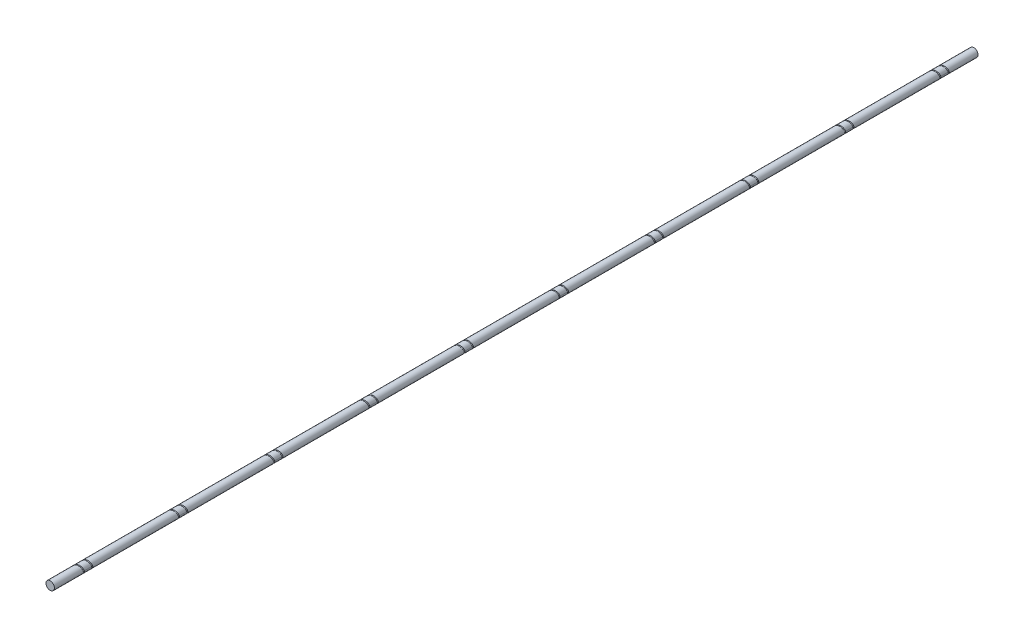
from build123d import *

# Parameters (mm, degrees)
SKETCH1_R              = 25
BOSS_EXTRUDE1_DEPTH    = 5500
CUT_SWEEP1_PITCH       = 50
CUT_SWEEP1_HEIGHT      = 100
CUT_SWEEP1_RADIUS      = 27.646
CUT_SWEEP1_START_ANGLE = -180
SKETCH3_R              = 3.969
LPATTERN1_COUNT        = 10
LPATTERN1_PITCH        = 566.666666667


with BuildPart() as part:
    # Sketch1 → Boss-Extrude1 (new body)
    with BuildSketch(Plane.XY):
        Circle(SKETCH1_R)
    extrude(amount=BOSS_EXTRUDE1_DEPTH)

    # Cut-Sweep1: sweep along a helix
    with BuildLine() as cut_sweep1_path:
        add(Helix(CUT_SWEEP1_PITCH, CUT_SWEEP1_HEIGHT, CUT_SWEEP1_RADIUS, center=(0, 0, 150), direction=(0, 0, 1), mode=Mode.PRIVATE).rotate(Axis((0, 0, 150), (0, 0, 1)), CUT_SWEEP1_START_ANGLE))
    # Sketch3 → Cut-Sweep1 (sweep, cut)
    with BuildSketch(Plane(origin=(0, 0, 0), x_dir=(1, 0, 0), z_dir=(0, 1, 0))):
        with Locations((-27.646, -150)):
            Circle(SKETCH3_R)
    cut_sweep1 = sweep(path=cut_sweep1_path.line, is_frenet=True, mode=Mode.SUBTRACT)

    # LPattern1: Cut-Sweep1 ×10
    with Locations(*[(0, 0, i * LPATTERN1_PITCH) for i in range(1, LPATTERN1_COUNT)]):
        add(cut_sweep1, mode=Mode.SUBTRACT)


solid = part.part
